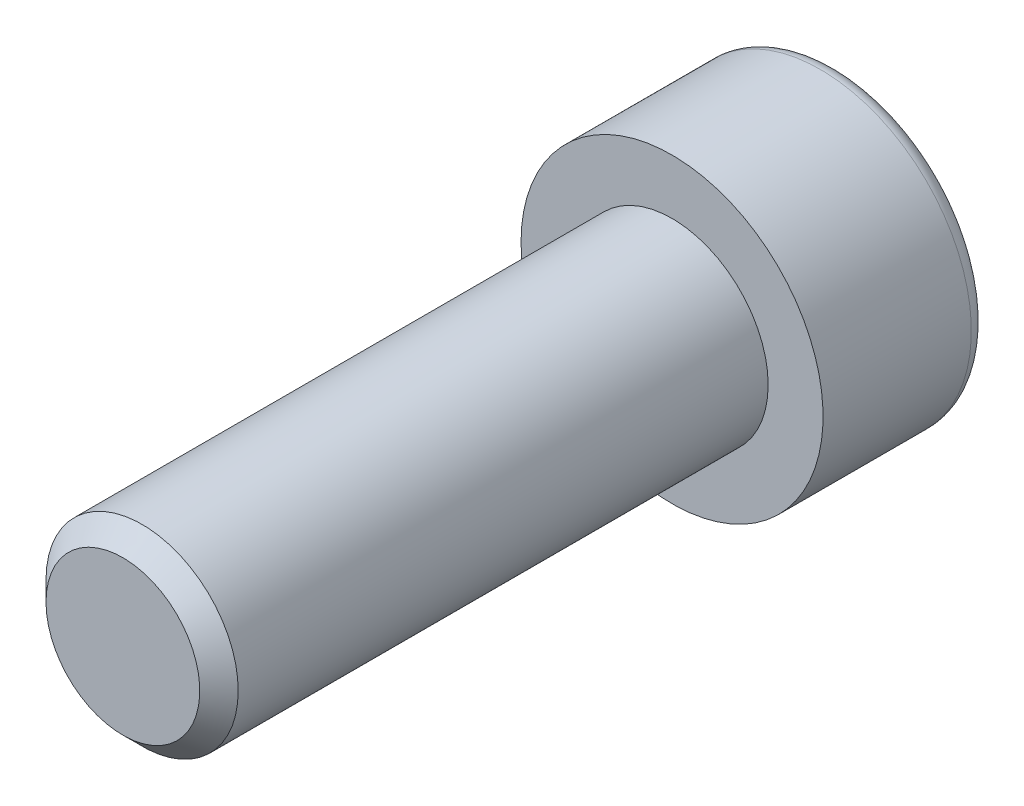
from build123d import *

# Parameters (mm, degrees)
ESQUISSE3_W            = 1.75
ESQUISSE3_H            = 10
ENLEV_MAT_EXTRU1_DEPTH = 1.3
CHANFREIN1_SIZE        = 0.35


with BuildPart() as part:
    # Esquisse3 → Boss.-R_vol.1 (revolve)
    with BuildSketch(Plane(origin=(0, 0, 0), x_dir=(1, 0, 0), z_dir=(0, 1, 0)), mode=Mode.PRIVATE) as boss_r_vol_1_sk:
        with Locations((0.875, -5)):
            Rectangle(ESQUISSE3_W, ESQUISSE3_H)
    revolve(boss_r_vol_1_sk.sketch.rotate(Axis((0, 0, 0), (0, 0, 1)), 180), axis=Axis((0, 0, 0), (0, 0, 1)))

    # Esquisse1 → Base-R_volution (revolve)
    with BuildSketch(Plane(origin=(0, 0, 0), x_dir=(1, 0, 0), z_dir=(0, 1, 0)), mode=Mode.PRIVATE) as base_r_volution_sk:
        with BuildLine():
            Line((0, 0), (2.75, 0))
            Line((2.75, 0), (2.75, 2.7))
            ThreePointArc((2.75, 2.7), (2.662132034, 2.912132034), (2.45, 3))
            Line((2.45, 3), (0, 3))
            Line((0, 3), (0, 0))
        make_face()
    revolve(base_r_volution_sk.sketch.rotate(Axis((0, 0, 0), (0, 0, -1)), 180), axis=Axis((0, 0, 0), (0, 0, -1)))

    # Esquisse2 → enlev-mat-Extru1 (cut)
    with BuildSketch(Plane.XY.offset(-3)):
        Polygon((1.25, -0.721687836), (1.25, 0.721687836), (0, 1.443375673), (-1.25, 0.721687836), (-1.25, -0.721687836), (0, -1.443375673), align=None)
    extrude(amount=ENLEV_MAT_EXTRU1_DEPTH, mode=Mode.SUBTRACT)

    # Chanfrein1
    chanfrein1_edges = [part.edges().sort_by_distance(p)[0] for p in [
        (1.75, 0, 10),
    ]]
    chamfer(chanfrein1_edges, length=CHANFREIN1_SIZE)


solid = part.part
